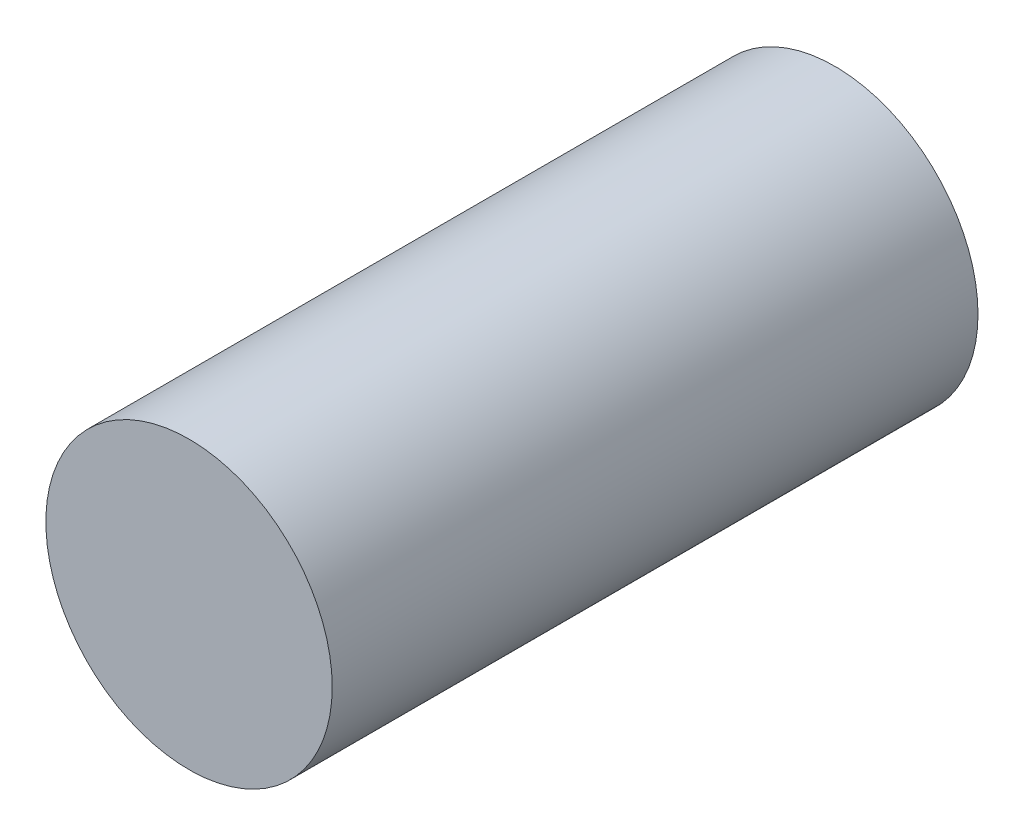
ISO-10303-21;
HEADER;
FILE_DESCRIPTION(('STEP AP214'),'2;1');
FILE_NAME('part.step','',(''),(''),'','','');
FILE_SCHEMA(('AUTOMOTIVE_DESIGN { 1 0 10303 214 1 1 1 1 }'));
ENDSEC;
DATA;
#1=APPLICATION_CONTEXT('core data for automotive mechanical design processes');
#2=APPLICATION_PROTOCOL_DEFINITION('international standard','automotive_design',2000,#1);
#3=PRODUCT_CONTEXT('',#1,'mechanical');
#4=PRODUCT('Part','Part','',(#3));
#5=PRODUCT_RELATED_PRODUCT_CATEGORY('part','',(#4));
#6=PRODUCT_DEFINITION_FORMATION('','',#4);
#7=PRODUCT_DEFINITION_CONTEXT('part definition',#1,'design');
#8=PRODUCT_DEFINITION('design','',#6,#7);
#9=PRODUCT_DEFINITION_SHAPE('','',#8);
#10=(LENGTH_UNIT() NAMED_UNIT(*) SI_UNIT(.MILLI.,.METRE.));
#11=(NAMED_UNIT(*) PLANE_ANGLE_UNIT() SI_UNIT($,.RADIAN.));
#12=(NAMED_UNIT(*) SI_UNIT($,.STERADIAN.) SOLID_ANGLE_UNIT());
#13=UNCERTAINTY_MEASURE_WITH_UNIT(LENGTH_MEASURE(1.E-05),#10,'distance_accuracy_value','');
#14=(GEOMETRIC_REPRESENTATION_CONTEXT(3) GLOBAL_UNCERTAINTY_ASSIGNED_CONTEXT((#13)) GLOBAL_UNIT_ASSIGNED_CONTEXT((#10,
#11,#12)) REPRESENTATION_CONTEXT('',''));
#15=CARTESIAN_POINT('',(0.,0.,0.));
#16=DIRECTION('',(0.,0.,1.));
#17=DIRECTION('',(1.,0.,0.));
#18=AXIS2_PLACEMENT_3D('',#15,#16,#17);
#19=CARTESIAN_POINT('',(0.,0.,-45.1));
#20=DIRECTION('',(0.,0.,1.));
#21=DIRECTION('',(1.,0.,0.));
#22=AXIS2_PLACEMENT_3D('',#19,#20,#21);
#23=CYLINDRICAL_SURFACE('',#22,10.);
#24=CARTESIAN_POINT('',(0.,0.,-45.1));
#25=DIRECTION('',(0.,0.,1.));
#26=DIRECTION('',(1.,0.,0.));
#27=AXIS2_PLACEMENT_3D('',#24,#25,#26);
#28=CIRCLE('',#27,10.);
#29=CARTESIAN_POINT('',(10.,0.,-45.1));
#30=VERTEX_POINT('',#29);
#31=EDGE_CURVE('E10',#30,#30,#28,.T.);
#32=ORIENTED_EDGE('',*,*,#31,.T.);
#33=EDGE_LOOP('',(#32));
#34=FACE_BOUND('',#33,.T.);
#35=CARTESIAN_POINT('',(0.,0.,0.));
#36=DIRECTION('',(0.,0.,1.));
#37=DIRECTION('',(1.,0.,0.));
#38=AXIS2_PLACEMENT_3D('',#35,#36,#37);
#39=CIRCLE('',#38,10.);
#40=CARTESIAN_POINT('',(10.,0.,0.));
#41=VERTEX_POINT('',#40);
#42=EDGE_CURVE('E33',#41,#41,#39,.T.);
#43=ORIENTED_EDGE('',*,*,#42,.F.);
#44=EDGE_LOOP('',(#43));
#45=FACE_BOUND('',#44,.T.);
#46=ADVANCED_FACE('F30',(#34,#45),#23,.T.);
#47=CARTESIAN_POINT('',(0.,0.,-45.1));
#48=DIRECTION('',(0.,0.,1.));
#49=DIRECTION('',(1.,0.,0.));
#50=AXIS2_PLACEMENT_3D('',#47,#48,#49);
#51=PLANE('',#50);
#52=ORIENTED_EDGE('',*,*,#31,.F.);
#53=EDGE_LOOP('',(#52));
#54=FACE_BOUND('',#53,.T.);
#55=ADVANCED_FACE('F45',(#54),#51,.F.);
#56=CARTESIAN_POINT('',(0.,0.,0.));
#57=DIRECTION('',(0.,0.,1.));
#58=DIRECTION('',(1.,0.,0.));
#59=AXIS2_PLACEMENT_3D('',#56,#57,#58);
#60=PLANE('',#59);
#61=ORIENTED_EDGE('',*,*,#42,.T.);
#62=EDGE_LOOP('',(#61));
#63=FACE_BOUND('',#62,.T.);
#64=ADVANCED_FACE('F42',(#63),#60,.T.);
#65=CLOSED_SHELL('',(#46,#55,#64));
#66=MANIFOLD_SOLID_BREP('B2',#65);
#67=ADVANCED_BREP_SHAPE_REPRESENTATION('',(#18,#66),#14);
#68=SHAPE_DEFINITION_REPRESENTATION(#9,#67);
ENDSEC;
END-ISO-10303-21;
